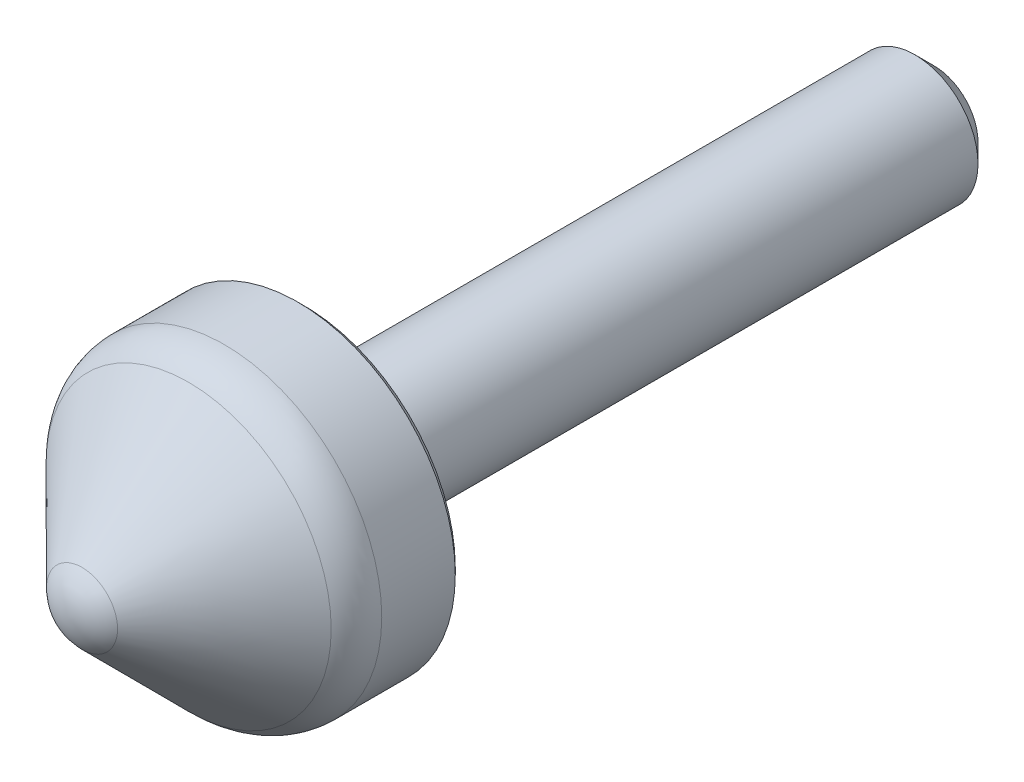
ISO-10303-21;
HEADER;
FILE_DESCRIPTION(('STEP AP214'),'2;1');
FILE_NAME('part.step','',(''),(''),'','','');
FILE_SCHEMA(('AUTOMOTIVE_DESIGN { 1 0 10303 214 1 1 1 1 }'));
ENDSEC;
DATA;
#1=APPLICATION_CONTEXT('core data for automotive mechanical design processes');
#2=APPLICATION_PROTOCOL_DEFINITION('international standard','automotive_design',2000,#1);
#3=PRODUCT_CONTEXT('',#1,'mechanical');
#4=PRODUCT('Part','Part','',(#3));
#5=PRODUCT_RELATED_PRODUCT_CATEGORY('part','',(#4));
#6=PRODUCT_DEFINITION_FORMATION('','',#4);
#7=PRODUCT_DEFINITION_CONTEXT('part definition',#1,'design');
#8=PRODUCT_DEFINITION('design','',#6,#7);
#9=PRODUCT_DEFINITION_SHAPE('','',#8);
#10=(LENGTH_UNIT() NAMED_UNIT(*) SI_UNIT(.MILLI.,.METRE.));
#11=(NAMED_UNIT(*) PLANE_ANGLE_UNIT() SI_UNIT($,.RADIAN.));
#12=(NAMED_UNIT(*) SI_UNIT($,.STERADIAN.) SOLID_ANGLE_UNIT());
#13=UNCERTAINTY_MEASURE_WITH_UNIT(LENGTH_MEASURE(1.E-05),#10,'distance_accuracy_value','');
#14=(GEOMETRIC_REPRESENTATION_CONTEXT(3) GLOBAL_UNCERTAINTY_ASSIGNED_CONTEXT((#13)) GLOBAL_UNIT_ASSIGNED_CONTEXT((#10,
#11,#12)) REPRESENTATION_CONTEXT('',''));
#15=CARTESIAN_POINT('',(0.,0.,0.));
#16=DIRECTION('',(0.,0.,1.));
#17=DIRECTION('',(1.,0.,0.));
#18=AXIS2_PLACEMENT_3D('',#15,#16,#17);
#19=CARTESIAN_POINT('',(0.,3.5,-50.));
#20=DIRECTION('',(0.,0.,-1.));
#21=DIRECTION('',(-1.,0.,0.));
#22=AXIS2_PLACEMENT_3D('',#19,#20,#21);
#23=PLANE('',#22);
#24=CARTESIAN_POINT('',(0.,0.,-50.));
#25=DIRECTION('',(0.,0.,1.));
#26=DIRECTION('',(1.,0.,0.));
#27=AXIS2_PLACEMENT_3D('',#24,#25,#26);
#28=CIRCLE('',#27,3.5);
#29=CARTESIAN_POINT('',(3.5,0.,-50.));
#30=VERTEX_POINT('',#29);
#31=EDGE_CURVE('E8',#30,#30,#28,.T.);
#32=ORIENTED_EDGE('',*,*,#31,.F.);
#33=EDGE_LOOP('',(#32));
#34=FACE_BOUND('',#33,.T.);
#35=ADVANCED_FACE('F12',(#34),#23,.T.);
#36=CARTESIAN_POINT('',(0.,0.,-48.5));
#37=DIRECTION('',(0.,0.,1.));
#38=DIRECTION('',(1.,0.,0.));
#39=AXIS2_PLACEMENT_3D('',#36,#37,#38);
#40=CONICAL_SURFACE('',#39,5.,0.785398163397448);
#41=ORIENTED_EDGE('',*,*,#31,.T.);
#42=EDGE_LOOP('',(#41));
#43=FACE_BOUND('',#42,.T.);
#44=CARTESIAN_POINT('',(0.,0.,-48.5));
#45=DIRECTION('',(0.,0.,1.));
#46=DIRECTION('',(1.,0.,0.));
#47=AXIS2_PLACEMENT_3D('',#44,#45,#46);
#48=CIRCLE('',#47,5.);
#49=CARTESIAN_POINT('',(5.,0.,-48.5));
#50=VERTEX_POINT('',#49);
#51=EDGE_CURVE('E18',#50,#50,#48,.T.);
#52=ORIENTED_EDGE('',*,*,#51,.F.);
#53=EDGE_LOOP('',(#52));
#54=FACE_BOUND('',#53,.T.);
#55=ADVANCED_FACE('F65',(#43,#54),#40,.T.);
#56=CARTESIAN_POINT('',(0.,0.,20.5));
#57=DIRECTION('',(0.,0.,1.));
#58=DIRECTION('',(1.,0.,0.));
#59=AXIS2_PLACEMENT_3D('',#56,#57,#58);
#60=CYLINDRICAL_SURFACE('',#59,5.);
#61=ORIENTED_EDGE('',*,*,#51,.T.);
#62=EDGE_LOOP('',(#61));
#63=FACE_BOUND('',#62,.T.);
#64=CARTESIAN_POINT('',(0.,0.,-1.));
#65=DIRECTION('',(0.,0.,1.));
#66=DIRECTION('',(1.,0.,0.));
#67=AXIS2_PLACEMENT_3D('',#64,#65,#66);
#68=CIRCLE('',#67,5.);
#69=CARTESIAN_POINT('',(5.,0.,-1.));
#70=VERTEX_POINT('',#69);
#71=EDGE_CURVE('E22',#70,#70,#68,.T.);
#72=ORIENTED_EDGE('',*,*,#71,.F.);
#73=EDGE_LOOP('',(#72));
#74=FACE_BOUND('',#73,.T.);
#75=ADVANCED_FACE('F71',(#63,#74),#60,.T.);
#76=CARTESIAN_POINT('',(0.,0.,-1.));
#77=DIRECTION('',(0.,0.,1.));
#78=DIRECTION('',(1.,0.,0.));
#79=AXIS2_PLACEMENT_3D('',#76,#77,#78);
#80=TOROIDAL_SURFACE('',#79,6.,1.);
#81=CARTESIAN_POINT('',(0.,0.,0.));
#82=DIRECTION('',(0.,0.,1.));
#83=DIRECTION('',(1.,0.,0.));
#84=AXIS2_PLACEMENT_3D('',#81,#82,#83);
#85=CIRCLE('',#84,6.);
#86=CARTESIAN_POINT('',(6.,0.,0.));
#87=VERTEX_POINT('',#86);
#88=EDGE_CURVE('E26',#87,#87,#85,.T.);
#89=ORIENTED_EDGE('',*,*,#88,.F.);
#90=EDGE_LOOP('',(#89));
#91=FACE_BOUND('',#90,.T.);
#92=ORIENTED_EDGE('',*,*,#71,.T.);
#93=EDGE_LOOP('',(#92));
#94=FACE_BOUND('',#93,.T.);
#95=ADVANCED_FACE('F76',(#91,#94),#80,.F.);
#96=CARTESIAN_POINT('',(0.,12.,0.));
#97=DIRECTION('',(0.,0.,-1.));
#98=DIRECTION('',(-1.,0.,0.));
#99=AXIS2_PLACEMENT_3D('',#96,#97,#98);
#100=PLANE('',#99);
#101=ORIENTED_EDGE('',*,*,#88,.T.);
#102=EDGE_LOOP('',(#101));
#103=FACE_BOUND('',#102,.T.);
#104=CARTESIAN_POINT('',(0.,0.,0.));
#105=DIRECTION('',(0.,0.,1.));
#106=DIRECTION('',(1.,0.,0.));
#107=AXIS2_PLACEMENT_3D('',#104,#105,#106);
#108=CIRCLE('',#107,12.);
#109=CARTESIAN_POINT('',(12.,0.,0.));
#110=VERTEX_POINT('',#109);
#111=EDGE_CURVE('E31',#110,#110,#108,.T.);
#112=ORIENTED_EDGE('',*,*,#111,.F.);
#113=EDGE_LOOP('',(#112));
#114=FACE_BOUND('',#113,.T.);
#115=ADVANCED_FACE('F82',(#103,#114),#100,.T.);
#116=CARTESIAN_POINT('',(0.,0.,0.5));
#117=DIRECTION('',(0.,0.,1.));
#118=DIRECTION('',(1.,0.,0.));
#119=AXIS2_PLACEMENT_3D('',#116,#117,#118);
#120=CONICAL_SURFACE('',#119,12.5,0.785398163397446);
#121=ORIENTED_EDGE('',*,*,#111,.T.);
#122=EDGE_LOOP('',(#121));
#123=FACE_BOUND('',#122,.T.);
#124=CARTESIAN_POINT('',(0.,0.,0.5));
#125=DIRECTION('',(0.,0.,1.));
#126=DIRECTION('',(1.,0.,0.));
#127=AXIS2_PLACEMENT_3D('',#124,#125,#126);
#128=CIRCLE('',#127,12.5);
#129=CARTESIAN_POINT('',(12.5,0.,0.5));
#130=VERTEX_POINT('',#129);
#131=EDGE_CURVE('E34',#130,#130,#128,.T.);
#132=ORIENTED_EDGE('',*,*,#131,.F.);
#133=EDGE_LOOP('',(#132));
#134=FACE_BOUND('',#133,.T.);
#135=ADVANCED_FACE('F86',(#123,#134),#120,.T.);
#136=CARTESIAN_POINT('',(0.,0.,20.5));
#137=DIRECTION('',(0.,0.,1.));
#138=DIRECTION('',(1.,0.,0.));
#139=AXIS2_PLACEMENT_3D('',#136,#137,#138);
#140=CYLINDRICAL_SURFACE('',#139,12.5);
#141=ORIENTED_EDGE('',*,*,#131,.T.);
#142=EDGE_LOOP('',(#141));
#143=FACE_BOUND('',#142,.T.);
#144=CARTESIAN_POINT('',(0.,0.,6.33790687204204));
#145=DIRECTION('',(0.,0.,1.));
#146=DIRECTION('',(1.,0.,0.));
#147=AXIS2_PLACEMENT_3D('',#144,#145,#146);
#148=CIRCLE('',#147,12.5);
#149=CARTESIAN_POINT('',(12.5,0.,6.33790687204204));
#150=VERTEX_POINT('',#149);
#151=EDGE_CURVE('E37',#150,#150,#148,.T.);
#152=ORIENTED_EDGE('',*,*,#151,.F.);
#153=EDGE_LOOP('',(#152));
#154=FACE_BOUND('',#153,.T.);
#155=ADVANCED_FACE('F61',(#143,#154),#140,.T.);
#156=CARTESIAN_POINT('',(0.,0.,6.33790687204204));
#157=DIRECTION('',(0.,0.,1.));
#158=DIRECTION('',(1.,0.,0.));
#159=AXIS2_PLACEMENT_3D('',#156,#157,#158);
#160=TOROIDAL_SURFACE('',#159,8.5,4.);
#161=ORIENTED_EDGE('',*,*,#151,.T.);
#162=EDGE_LOOP('',(#161));
#163=FACE_BOUND('',#162,.T.);
#164=CARTESIAN_POINT('',(0.,0.,9.17264788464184));
#165=DIRECTION('',(0.,0.,1.));
#166=DIRECTION('',(1.,0.,0.));
#167=AXIS2_PLACEMENT_3D('',#164,#165,#166);
#168=CIRCLE('',#167,11.3220991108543);
#169=CARTESIAN_POINT('',(-11.3220991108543,0.,9.17264788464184));
#170=VERTEX_POINT('',#169);
#171=EDGE_CURVE('E40',#170,#170,#168,.T.);
#172=ORIENTED_EDGE('',*,*,#171,.F.);
#173=EDGE_LOOP('',(#172));
#174=FACE_BOUND('',#173,.T.);
#175=ADVANCED_FACE('F51',(#163,#174),#160,.T.);
#176=CARTESIAN_POINT('',(0.,0.,17.6347410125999));
#177=DIRECTION('',(0.,0.,-1.));
#178=DIRECTION('',(-1.,0.,0.));
#179=AXIS2_PLACEMENT_3D('',#176,#177,#178);
#180=CONICAL_SURFACE('',#179,2.8220991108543,0.787632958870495);
#181=CARTESIAN_POINT('',(0.,0.,17.6347410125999));
#182=DIRECTION('',(0.,0.,1.));
#183=DIRECTION('',(1.,0.,0.));
#184=AXIS2_PLACEMENT_3D('',#181,#182,#183);
#185=CIRCLE('',#184,2.8220991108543);
#186=CARTESIAN_POINT('',(-2.8220991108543,0.,17.6347410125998));
#187=VERTEX_POINT('',#186);
#188=EDGE_CURVE('E43',#187,#187,#185,.T.);
#189=CARTESIAN_POINT('',(-11.3220991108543,0.,9.17264788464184));
#190=CARTESIAN_POINT('',(-11.2335574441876,0.,9.26079468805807));
#191=CARTESIAN_POINT('',(-11.145015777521,0.,9.3489414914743));
#192=CARTESIAN_POINT('',(-10.9679324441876,0.,9.52523509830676));
#193=CARTESIAN_POINT('',(-10.879390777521,0.,9.61338190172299));
#194=CARTESIAN_POINT('',(-10.7023074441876,0.,9.78967550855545));
#195=CARTESIAN_POINT('',(-10.613765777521,0.,9.87782231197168));
#196=CARTESIAN_POINT('',(-10.4366824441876,0.,10.0541159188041));
#197=CARTESIAN_POINT('',(-10.348140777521,0.,10.1422627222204));
#198=CARTESIAN_POINT('',(-10.1710574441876,0.,10.3185563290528));
#199=CARTESIAN_POINT('',(-10.082515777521,0.,10.406703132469));
#200=CARTESIAN_POINT('',(-9.90543244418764,0.,10.5829967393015));
#201=CARTESIAN_POINT('',(-9.81689077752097,0.,10.6711435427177));
#202=CARTESIAN_POINT('',(-9.63980744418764,0.,10.8474371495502));
#203=CARTESIAN_POINT('',(-9.55126577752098,0.,10.9355839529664));
#204=CARTESIAN_POINT('',(-9.37418244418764,0.,11.1118775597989));
#205=CARTESIAN_POINT('',(-9.28564077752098,0.,11.2000243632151));
#206=CARTESIAN_POINT('',(-9.10855744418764,0.,11.3763179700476));
#207=CARTESIAN_POINT('',(-9.02001577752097,0.,11.4644647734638));
#208=CARTESIAN_POINT('',(-8.84293244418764,0.,11.6407583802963));
#209=CARTESIAN_POINT('',(-8.75439077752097,0.,11.7289051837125));
#210=CARTESIAN_POINT('',(-8.57730744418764,0.,11.9051987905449));
#211=CARTESIAN_POINT('',(-8.48876577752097,0.,11.9933455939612));
#212=CARTESIAN_POINT('',(-8.31168244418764,0.,12.1696392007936));
#213=CARTESIAN_POINT('',(-8.22314077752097,0.,12.2577860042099));
#214=CARTESIAN_POINT('',(-8.04605744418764,0.,12.4340796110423));
#215=CARTESIAN_POINT('',(-7.95751577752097,0.,12.5222264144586));
#216=CARTESIAN_POINT('',(-7.78043244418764,0.,12.698520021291));
#217=CARTESIAN_POINT('',(-7.69189077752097,0.,12.7866668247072));
#218=CARTESIAN_POINT('',(-7.51480744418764,0.,12.9629604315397));
#219=CARTESIAN_POINT('',(-7.42626577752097,0.,13.0511072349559));
#220=CARTESIAN_POINT('',(-7.24918244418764,0.,13.2274008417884));
#221=CARTESIAN_POINT('',(-7.16064077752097,0.,13.3155476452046));
#222=CARTESIAN_POINT('',(-6.98355744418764,0.,13.4918412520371));
#223=CARTESIAN_POINT('',(-6.89501577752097,0.,13.5799880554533));
#224=CARTESIAN_POINT('',(-6.71793244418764,0.,13.7562816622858));
#225=CARTESIAN_POINT('',(-6.62939077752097,0.,13.844428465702));
#226=CARTESIAN_POINT('',(-6.45230744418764,0.,14.0207220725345));
#227=CARTESIAN_POINT('',(-6.36376577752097,0.,14.1088688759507));
#228=CARTESIAN_POINT('',(-6.18668244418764,0.,14.2851624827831));
#229=CARTESIAN_POINT('',(-6.09814077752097,0.,14.3733092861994));
#230=CARTESIAN_POINT('',(-5.92105744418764,0.,14.5496028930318));
#231=CARTESIAN_POINT('',(-5.83251577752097,0.,14.6377496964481));
#232=CARTESIAN_POINT('',(-5.65543244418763,0.,14.8140433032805));
#233=CARTESIAN_POINT('',(-5.56689077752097,0.,14.9021901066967));
#234=CARTESIAN_POINT('',(-5.38980744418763,0.,15.0784837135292));
#235=CARTESIAN_POINT('',(-5.30126577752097,0.,15.1666305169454));
#236=CARTESIAN_POINT('',(-5.12418244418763,0.,15.3429241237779));
#237=CARTESIAN_POINT('',(-5.03564077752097,0.,15.4310709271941));
#238=CARTESIAN_POINT('',(-4.85855744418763,0.,15.6073645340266));
#239=CARTESIAN_POINT('',(-4.77001577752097,0.,15.6955113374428));
#240=CARTESIAN_POINT('',(-4.59293244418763,0.,15.8718049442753));
#241=CARTESIAN_POINT('',(-4.50439077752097,0.,15.9599517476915));
#242=CARTESIAN_POINT('',(-4.32730744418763,0.,16.136245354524));
#243=CARTESIAN_POINT('',(-4.23876577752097,0.,16.2243921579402));
#244=CARTESIAN_POINT('',(-4.06168244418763,0.,16.4006857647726));
#245=CARTESIAN_POINT('',(-3.97314077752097,0.,16.4888325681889));
#246=CARTESIAN_POINT('',(-3.79605744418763,0.,16.6651261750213));
#247=CARTESIAN_POINT('',(-3.70751577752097,0.,16.7532729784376));
#248=CARTESIAN_POINT('',(-3.53043244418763,0.,16.92956658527));
#249=CARTESIAN_POINT('',(-3.44189077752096,0.,17.0177133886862));
#250=CARTESIAN_POINT('',(-3.26480744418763,0.,17.1940069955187));
#251=CARTESIAN_POINT('',(-3.17626577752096,0.,17.2821537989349));
#252=CARTESIAN_POINT('',(-2.99918244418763,0.,17.4584474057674));
#253=CARTESIAN_POINT('',(-2.91064077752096,0.,17.5465942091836));
#254=CARTESIAN_POINT('',(-2.8220991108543,0.,17.6347410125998));
#255=B_SPLINE_CURVE_WITH_KNOTS('',3,(#189,#190,#191,#192,#193,#194,#195,#196,#197,#198,#199,
#200,#201,#202,#203,#204,#205,#206,#207,#208,#209,#210,#211,#212,#213,#214,#215,#216,#217,#218,
#219,#220,#221,#222,#223,#224,#225,#226,#227,#228,#229,#230,#231,#232,#233,#234,#235,#236,#237,
#238,#239,#240,#241,#242,#243,#244,#245,#246,#247,#248,#249,#250,#251,#252,#253,#254),
.UNSPECIFIED.,.F.,.F.,(4,2,2,2,2,2,2,2,2,2,2,2,2,2,2,2,2,2,2,2,2,2,2,2,2,2,2,2,2,2,2,2,4),(0.,
0.374813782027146,0.749627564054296,1.12444134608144,1.49925512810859,1.87406891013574,
2.24888269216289,2.62369647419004,2.99851025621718,3.37332403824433,3.74813782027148,
4.12295160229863,4.49776538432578,4.87257916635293,5.24739294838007,5.62220673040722,
5.99702051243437,6.37183429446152,6.74664807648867,7.12146185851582,7.49627564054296,
7.87108942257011,8.24590320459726,8.62071698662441,8.99553076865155,9.3703445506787,
9.74515833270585,10.119972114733,10.4947858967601,10.8695996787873,11.2444134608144,
11.6192272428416,11.9940410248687),.UNSPECIFIED.);
#256=EDGE_CURVE('BSEAM49',#170,#187,#255,.T.);
#257=ORIENTED_EDGE('',*,*,#171,.T.);
#258=ORIENTED_EDGE('',*,*,#188,.F.);
#259=ORIENTED_EDGE('',*,*,#256,.T.);
#260=ORIENTED_EDGE('',*,*,#256,.F.);
#261=EDGE_LOOP('',(#257,#259,#258,#260));
#262=FACE_BOUND('',#261,.T.);
#263=ADVANCED_FACE('F49',(#262),#180,.T.);
#264=CARTESIAN_POINT('',(0.,0.,14.8));
#265=DIRECTION('',(1.,0.,0.));
#266=DIRECTION('',(0.,0.,-1.));
#267=AXIS2_PLACEMENT_3D('',#264,#265,#266);
#268=SPHERICAL_SURFACE('',#267,4.);
#269=CARTESIAN_POINT('',(0.,0.,14.8));
#270=DIRECTION('',(0.,0.,1.));
#271=DIRECTION('',(1.,0.,0.));
#272=AXIS2_PLACEMENT_3D('',#269,#270,#271);
#273=SPHERICAL_SURFACE('',#272,4.);
#274=ORIENTED_EDGE('',*,*,#188,.T.);
#275=EDGE_LOOP('',(#274));
#276=FACE_BOUND('',#275,.T.);
#277=ADVANCED_FACE('F47',(#276),#273,.T.);
#278=CLOSED_SHELL('',(#35,#55,#75,#95,#115,#135,#155,#175,#263,#277));
#279=MANIFOLD_SOLID_BREP('B1',#278);
#280=ADVANCED_BREP_SHAPE_REPRESENTATION('',(#18,#279),#14);
#281=SHAPE_DEFINITION_REPRESENTATION(#9,#280);
ENDSEC;
END-ISO-10303-21;
